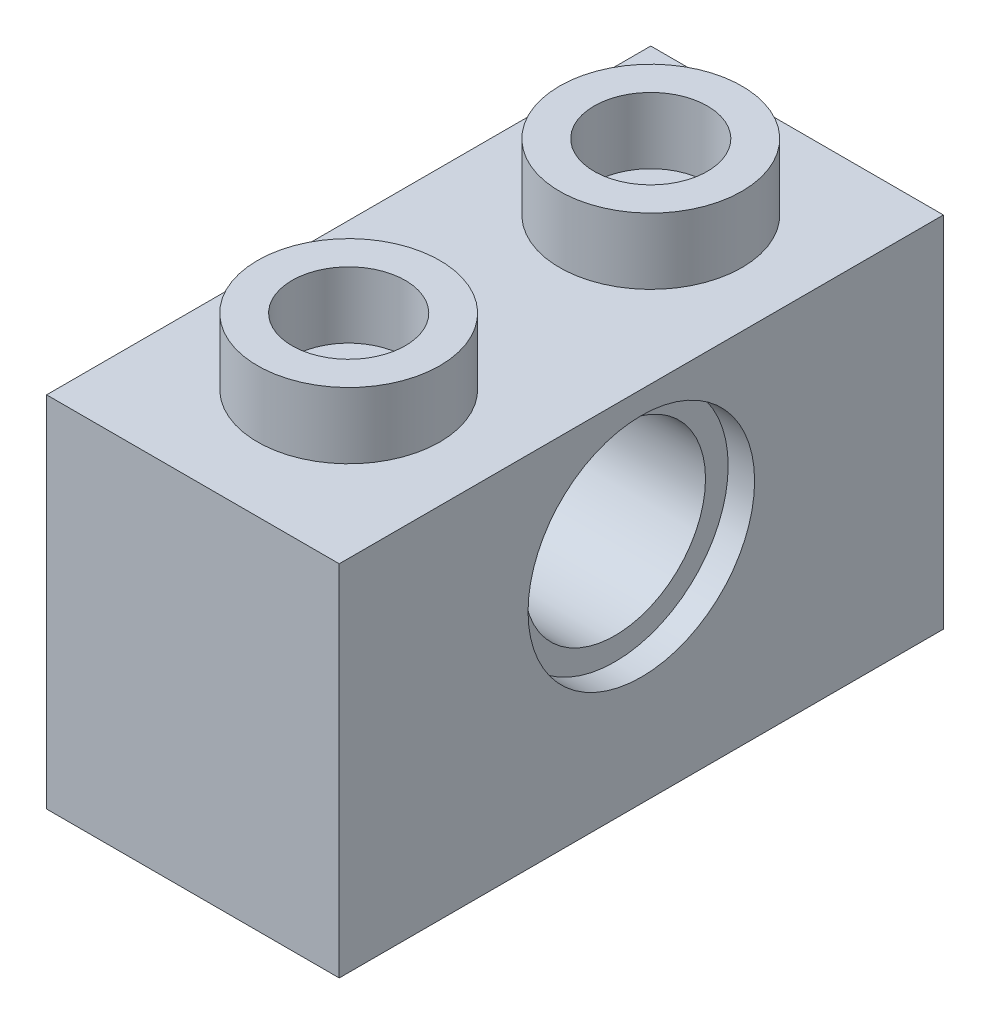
ISO-10303-21;
HEADER;
FILE_DESCRIPTION(('STEP AP214'),'2;1');
FILE_NAME('part.step','',(''),(''),'','','');
FILE_SCHEMA(('AUTOMOTIVE_DESIGN { 1 0 10303 214 1 1 1 1 }'));
ENDSEC;
DATA;
#1=APPLICATION_CONTEXT('core data for automotive mechanical design processes');
#2=APPLICATION_PROTOCOL_DEFINITION('international standard','automotive_design',2000,#1);
#3=PRODUCT_CONTEXT('',#1,'mechanical');
#4=PRODUCT('Part','Part','',(#3));
#5=PRODUCT_RELATED_PRODUCT_CATEGORY('part','',(#4));
#6=PRODUCT_DEFINITION_FORMATION('','',#4);
#7=PRODUCT_DEFINITION_CONTEXT('part definition',#1,'design');
#8=PRODUCT_DEFINITION('design','',#6,#7);
#9=PRODUCT_DEFINITION_SHAPE('','',#8);
#10=(LENGTH_UNIT() NAMED_UNIT(*) SI_UNIT(.MILLI.,.METRE.));
#11=(NAMED_UNIT(*) PLANE_ANGLE_UNIT() SI_UNIT($,.RADIAN.));
#12=(NAMED_UNIT(*) SI_UNIT($,.STERADIAN.) SOLID_ANGLE_UNIT());
#13=UNCERTAINTY_MEASURE_WITH_UNIT(LENGTH_MEASURE(1.E-05),#10,'distance_accuracy_value','');
#14=(GEOMETRIC_REPRESENTATION_CONTEXT(3) GLOBAL_UNCERTAINTY_ASSIGNED_CONTEXT((#13)) GLOBAL_UNIT_ASSIGNED_CONTEXT((#10,
#11,#12)) REPRESENTATION_CONTEXT('',''));
#15=CARTESIAN_POINT('',(0.,0.,0.));
#16=DIRECTION('',(0.,0.,1.));
#17=DIRECTION('',(1.,0.,0.));
#18=AXIS2_PLACEMENT_3D('',#15,#16,#17);
#19=CARTESIAN_POINT('',(-2.425,-3.,1.45));
#20=DIRECTION('',(0.,-1.,0.));
#21=DIRECTION('',(0.,0.,-1.));
#22=AXIS2_PLACEMENT_3D('',#19,#20,#21);
#23=PLANE('',#22);
#24=DIRECTION('',(0.,0.,-1.));
#25=VECTOR('',#24,1.);
#26=CARTESIAN_POINT('',(-2.425,-3.,14.55));
#27=LINE('',#26,#25);
#28=CARTESIAN_POINT('',(-2.425,-3.,14.55));
#29=VERTEX_POINT('',#28);
#30=CARTESIAN_POINT('',(-2.425,-3.,1.45));
#31=VERTEX_POINT('',#30);
#32=EDGE_CURVE('E114',#29,#31,#27,.T.);
#33=ORIENTED_EDGE('',*,*,#32,.T.);
#34=DIRECTION('',(1.,0.,0.));
#35=VECTOR('',#34,1.);
#36=CARTESIAN_POINT('',(-2.425,-3.,1.45));
#37=LINE('',#36,#35);
#38=CARTESIAN_POINT('',(2.425,-3.,1.45));
#39=VERTEX_POINT('',#38);
#40=EDGE_CURVE('E123',#31,#39,#37,.T.);
#41=ORIENTED_EDGE('',*,*,#40,.T.);
#42=DIRECTION('',(0.,0.,1.));
#43=VECTOR('',#42,1.);
#44=CARTESIAN_POINT('',(2.425,-3.,14.55));
#45=LINE('',#44,#43);
#46=CARTESIAN_POINT('',(2.425,-3.,14.55));
#47=VERTEX_POINT('',#46);
#48=EDGE_CURVE('E128',#39,#47,#45,.T.);
#49=ORIENTED_EDGE('',*,*,#48,.T.);
#50=DIRECTION('',(-1.,0.,0.));
#51=VECTOR('',#50,1.);
#52=CARTESIAN_POINT('',(-2.425,-3.,14.55));
#53=LINE('',#52,#51);
#54=EDGE_CURVE('E120',#47,#29,#53,.T.);
#55=ORIENTED_EDGE('',*,*,#54,.T.);
#56=EDGE_LOOP('',(#33,#41,#49,#55));
#57=FACE_BOUND('',#56,.T.);
#58=CARTESIAN_POINT('',(0.,-3.,8.));
#59=DIRECTION('',(0.,-1.,0.));
#60=DIRECTION('',(0.,0.,-1.));
#61=AXIS2_PLACEMENT_3D('',#58,#59,#60);
#62=CIRCLE('',#61,1.5);
#63=CARTESIAN_POINT('',(0.,-3.,6.5));
#64=VERTEX_POINT('',#63);
#65=EDGE_CURVE('E138',#64,#64,#62,.T.);
#66=ORIENTED_EDGE('',*,*,#65,.F.);
#67=EDGE_LOOP('',(#66));
#68=FACE_BOUND('',#67,.T.);
#69=ADVANCED_FACE('F37',(#57,#68),#23,.T.);
#70=CARTESIAN_POINT('',(3.875,4.75,16.));
#71=DIRECTION('',(0.,-1.,0.));
#72=DIRECTION('',(1.,0.,0.));
#73=AXIS2_PLACEMENT_3D('',#70,#71,#72);
#74=PLANE('',#73);
#75=DIRECTION('',(-1.,0.,0.));
#76=VECTOR('',#75,1.);
#77=CARTESIAN_POINT('',(3.875,4.75,0.));
#78=LINE('',#77,#76);
#79=CARTESIAN_POINT('',(3.875,4.75,0.));
#80=VERTEX_POINT('',#79);
#81=CARTESIAN_POINT('',(-3.875,4.75,0.));
#82=VERTEX_POINT('',#81);
#83=EDGE_CURVE('E82',#80,#82,#78,.T.);
#84=ORIENTED_EDGE('',*,*,#83,.T.);
#85=DIRECTION('',(0.,0.,-1.));
#86=VECTOR('',#85,1.);
#87=CARTESIAN_POINT('',(-3.875,4.75,16.));
#88=LINE('',#87,#86);
#89=CARTESIAN_POINT('',(-3.875,4.75,16.));
#90=VERTEX_POINT('',#89);
#91=EDGE_CURVE('E179',#90,#82,#88,.T.);
#92=ORIENTED_EDGE('',*,*,#91,.F.);
#93=DIRECTION('',(-1.,0.,0.));
#94=VECTOR('',#93,1.);
#95=CARTESIAN_POINT('',(3.875,4.75,16.));
#96=LINE('',#95,#94);
#97=CARTESIAN_POINT('',(3.875,4.75,16.));
#98=VERTEX_POINT('',#97);
#99=EDGE_CURVE('E61',#98,#90,#96,.T.);
#100=ORIENTED_EDGE('',*,*,#99,.F.);
#101=DIRECTION('',(0.,0.,-1.));
#102=VECTOR('',#101,1.);
#103=CARTESIAN_POINT('',(3.875,4.75,16.));
#104=LINE('',#103,#102);
#105=EDGE_CURVE('E188',#98,#80,#104,.T.);
#106=ORIENTED_EDGE('',*,*,#105,.T.);
#107=EDGE_LOOP('',(#84,#92,#100,#106));
#108=FACE_BOUND('',#107,.T.);
#109=CARTESIAN_POINT('',(0.,4.75,3.875));
#110=DIRECTION('',(0.,-1.,0.));
#111=DIRECTION('',(1.,0.,0.));
#112=AXIS2_PLACEMENT_3D('',#109,#110,#111);
#113=CIRCLE('',#112,2.415);
#114=CARTESIAN_POINT('',(2.415,4.75,3.875));
#115=VERTEX_POINT('',#114);
#116=EDGE_CURVE('E45',#115,#115,#113,.F.);
#117=ORIENTED_EDGE('',*,*,#116,.F.);
#118=EDGE_LOOP('',(#117));
#119=FACE_BOUND('',#118,.T.);
#120=CARTESIAN_POINT('',(0.,4.75,11.875));
#121=DIRECTION('',(0.,-1.,0.));
#122=DIRECTION('',(1.,0.,0.));
#123=AXIS2_PLACEMENT_3D('',#120,#121,#122);
#124=CIRCLE('',#123,2.415);
#125=CARTESIAN_POINT('',(2.415,4.75,11.875));
#126=VERTEX_POINT('',#125);
#127=EDGE_CURVE('E11',#126,#126,#124,.F.);
#128=ORIENTED_EDGE('',*,*,#127,.F.);
#129=EDGE_LOOP('',(#128));
#130=FACE_BOUND('',#129,.T.);
#131=ADVANCED_FACE('F199',(#108,#119,#130),#74,.F.);
#132=CARTESIAN_POINT('',(-3.875,-4.75,16.));
#133=DIRECTION('',(1.,0.,0.));
#134=DIRECTION('',(0.,0.,-1.));
#135=AXIS2_PLACEMENT_3D('',#132,#133,#134);
#136=PLANE('',#135);
#137=CARTESIAN_POINT('',(-3.875,1.15,8.));
#138=DIRECTION('',(-1.,0.,0.));
#139=DIRECTION('',(0.,0.,1.));
#140=AXIS2_PLACEMENT_3D('',#137,#138,#139);
#141=CIRCLE('',#140,3.);
#142=CARTESIAN_POINT('',(-3.875,1.15,11.));
#143=VERTEX_POINT('',#142);
#144=EDGE_CURVE('E300',#143,#143,#141,.T.);
#145=ORIENTED_EDGE('',*,*,#144,.F.);
#146=EDGE_LOOP('',(#145));
#147=FACE_BOUND('',#146,.T.);
#148=DIRECTION('',(0.,-1.,0.));
#149=VECTOR('',#148,1.);
#150=CARTESIAN_POINT('',(-3.875,-4.75,0.));
#151=LINE('',#150,#149);
#152=CARTESIAN_POINT('',(-3.875,-4.75,0.));
#153=VERTEX_POINT('',#152);
#154=EDGE_CURVE('E172',#82,#153,#151,.T.);
#155=ORIENTED_EDGE('',*,*,#154,.T.);
#156=DIRECTION('',(0.,0.,-1.));
#157=VECTOR('',#156,1.);
#158=CARTESIAN_POINT('',(-3.875,-4.75,16.));
#159=LINE('',#158,#157);
#160=CARTESIAN_POINT('',(-3.875,-4.75,16.));
#161=VERTEX_POINT('',#160);
#162=EDGE_CURVE('E193',#161,#153,#159,.T.);
#163=ORIENTED_EDGE('',*,*,#162,.F.);
#164=DIRECTION('',(0.,-1.,0.));
#165=VECTOR('',#164,1.);
#166=CARTESIAN_POINT('',(-3.875,-4.75,16.));
#167=LINE('',#166,#165);
#168=EDGE_CURVE('E173',#90,#161,#167,.T.);
#169=ORIENTED_EDGE('',*,*,#168,.F.);
#170=ORIENTED_EDGE('',*,*,#91,.T.);
#171=EDGE_LOOP('',(#155,#163,#169,#170));
#172=FACE_BOUND('',#171,.T.);
#173=ADVANCED_FACE('F39',(#147,#172),#136,.F.);
#174=CARTESIAN_POINT('',(3.875,-4.75,16.));
#175=DIRECTION('',(0.,1.,0.));
#176=DIRECTION('',(0.,0.,1.));
#177=AXIS2_PLACEMENT_3D('',#174,#175,#176);
#178=PLANE('',#177);
#179=DIRECTION('',(1.,0.,0.));
#180=VECTOR('',#179,1.);
#181=CARTESIAN_POINT('',(-2.425,-4.75,1.45));
#182=LINE('',#181,#180);
#183=CARTESIAN_POINT('',(-2.425,-4.75,1.45));
#184=VERTEX_POINT('',#183);
#185=CARTESIAN_POINT('',(2.425,-4.75,1.45));
#186=VERTEX_POINT('',#185);
#187=EDGE_CURVE('E144',#184,#186,#182,.T.);
#188=ORIENTED_EDGE('',*,*,#187,.F.);
#189=DIRECTION('',(0.,0.,-1.));
#190=VECTOR('',#189,1.);
#191=CARTESIAN_POINT('',(-2.425,-4.75,14.55));
#192=LINE('',#191,#190);
#193=CARTESIAN_POINT('',(-2.425,-4.75,14.55));
#194=VERTEX_POINT('',#193);
#195=EDGE_CURVE('E52',#194,#184,#192,.T.);
#196=ORIENTED_EDGE('',*,*,#195,.F.);
#197=DIRECTION('',(-1.,0.,0.));
#198=VECTOR('',#197,1.);
#199=CARTESIAN_POINT('',(-2.425,-4.75,14.55));
#200=LINE('',#199,#198);
#201=CARTESIAN_POINT('',(2.425,-4.75,14.55));
#202=VERTEX_POINT('',#201);
#203=EDGE_CURVE('E132',#202,#194,#200,.T.);
#204=ORIENTED_EDGE('',*,*,#203,.F.);
#205=DIRECTION('',(0.,0.,1.));
#206=VECTOR('',#205,1.);
#207=CARTESIAN_POINT('',(2.425,-4.75,14.55));
#208=LINE('',#207,#206);
#209=EDGE_CURVE('E135',#186,#202,#208,.T.);
#210=ORIENTED_EDGE('',*,*,#209,.F.);
#211=EDGE_LOOP('',(#188,#196,#204,#210));
#212=FACE_BOUND('',#211,.T.);
#213=DIRECTION('',(1.,0.,0.));
#214=VECTOR('',#213,1.);
#215=CARTESIAN_POINT('',(3.875,-4.75,0.));
#216=LINE('',#215,#214);
#217=CARTESIAN_POINT('',(3.875,-4.75,0.));
#218=VERTEX_POINT('',#217);
#219=EDGE_CURVE('E182',#153,#218,#216,.T.);
#220=ORIENTED_EDGE('',*,*,#219,.T.);
#221=DIRECTION('',(0.,0.,-1.));
#222=VECTOR('',#221,1.);
#223=CARTESIAN_POINT('',(3.875,-4.75,16.));
#224=LINE('',#223,#222);
#225=CARTESIAN_POINT('',(3.875,-4.75,16.));
#226=VERTEX_POINT('',#225);
#227=EDGE_CURVE('E190',#226,#218,#224,.T.);
#228=ORIENTED_EDGE('',*,*,#227,.F.);
#229=DIRECTION('',(1.,0.,0.));
#230=VECTOR('',#229,1.);
#231=CARTESIAN_POINT('',(3.875,-4.75,16.));
#232=LINE('',#231,#230);
#233=EDGE_CURVE('E90',#161,#226,#232,.T.);
#234=ORIENTED_EDGE('',*,*,#233,.F.);
#235=ORIENTED_EDGE('',*,*,#162,.T.);
#236=EDGE_LOOP('',(#220,#228,#234,#235));
#237=FACE_BOUND('',#236,.T.);
#238=ADVANCED_FACE('F285',(#212,#237),#178,.F.);
#239=CARTESIAN_POINT('',(3.875,-4.75,16.));
#240=DIRECTION('',(-1.,0.,0.));
#241=DIRECTION('',(0.,0.,1.));
#242=AXIS2_PLACEMENT_3D('',#239,#240,#241);
#243=PLANE('',#242);
#244=CARTESIAN_POINT('',(3.875,1.15,8.));
#245=DIRECTION('',(1.,0.,0.));
#246=DIRECTION('',(0.,0.,-1.));
#247=AXIS2_PLACEMENT_3D('',#244,#245,#246);
#248=CIRCLE('',#247,3.);
#249=CARTESIAN_POINT('',(3.875,1.15,5.));
#250=VERTEX_POINT('',#249);
#251=EDGE_CURVE('E306',#250,#250,#248,.T.);
#252=ORIENTED_EDGE('',*,*,#251,.F.);
#253=EDGE_LOOP('',(#252));
#254=FACE_BOUND('',#253,.T.);
#255=DIRECTION('',(0.,1.,0.));
#256=VECTOR('',#255,1.);
#257=CARTESIAN_POINT('',(3.875,-4.75,0.));
#258=LINE('',#257,#256);
#259=EDGE_CURVE('E184',#218,#80,#258,.T.);
#260=ORIENTED_EDGE('',*,*,#259,.T.);
#261=ORIENTED_EDGE('',*,*,#105,.F.);
#262=DIRECTION('',(0.,1.,0.));
#263=VECTOR('',#262,1.);
#264=CARTESIAN_POINT('',(3.875,-4.75,16.));
#265=LINE('',#264,#263);
#266=EDGE_CURVE('E176',#226,#98,#265,.T.);
#267=ORIENTED_EDGE('',*,*,#266,.F.);
#268=ORIENTED_EDGE('',*,*,#227,.T.);
#269=EDGE_LOOP('',(#260,#261,#267,#268));
#270=FACE_BOUND('',#269,.T.);
#271=ADVANCED_FACE('F272',(#254,#270),#243,.F.);
#272=CARTESIAN_POINT('',(-3.875,4.75,16.));
#273=DIRECTION('',(0.,0.,1.));
#274=DIRECTION('',(1.,0.,0.));
#275=AXIS2_PLACEMENT_3D('',#272,#273,#274);
#276=PLANE('',#275);
#277=ORIENTED_EDGE('',*,*,#168,.T.);
#278=ORIENTED_EDGE('',*,*,#233,.T.);
#279=ORIENTED_EDGE('',*,*,#266,.T.);
#280=ORIENTED_EDGE('',*,*,#99,.T.);
#281=EDGE_LOOP('',(#277,#278,#279,#280));
#282=FACE_BOUND('',#281,.T.);
#283=ADVANCED_FACE('F270',(#282),#276,.T.);
#284=CARTESIAN_POINT('',(-3.875,4.75,0.));
#285=DIRECTION('',(0.,0.,1.));
#286=DIRECTION('',(1.,0.,0.));
#287=AXIS2_PLACEMENT_3D('',#284,#285,#286);
#288=PLANE('',#287);
#289=ORIENTED_EDGE('',*,*,#154,.F.);
#290=ORIENTED_EDGE('',*,*,#83,.F.);
#291=ORIENTED_EDGE('',*,*,#259,.F.);
#292=ORIENTED_EDGE('',*,*,#219,.F.);
#293=EDGE_LOOP('',(#289,#290,#291,#292));
#294=FACE_BOUND('',#293,.T.);
#295=ADVANCED_FACE('F267',(#294),#288,.F.);
#296=CARTESIAN_POINT('',(0.,6.5,3.875));
#297=DIRECTION('',(0.,1.,0.));
#298=DIRECTION('',(-1.,0.,0.));
#299=AXIS2_PLACEMENT_3D('',#296,#297,#298);
#300=PLANE('',#299);
#301=CARTESIAN_POINT('',(0.,6.5,3.875));
#302=DIRECTION('',(0.,1.,0.));
#303=DIRECTION('',(-1.,0.,0.));
#304=AXIS2_PLACEMENT_3D('',#301,#302,#303);
#305=CIRCLE('',#304,2.415);
#306=CARTESIAN_POINT('',(-2.415,6.5,3.875));
#307=VERTEX_POINT('',#306);
#308=EDGE_CURVE('E167',#307,#307,#305,.T.);
#309=ORIENTED_EDGE('',*,*,#308,.T.);
#310=EDGE_LOOP('',(#309));
#311=FACE_BOUND('',#310,.T.);
#312=CARTESIAN_POINT('',(0.,6.5,3.875));
#313=DIRECTION('',(0.,1.,0.));
#314=DIRECTION('',(-1.,0.,0.));
#315=AXIS2_PLACEMENT_3D('',#312,#313,#314);
#316=CIRCLE('',#315,1.5);
#317=CARTESIAN_POINT('',(-1.5,6.5,3.875));
#318=VERTEX_POINT('',#317);
#319=EDGE_CURVE('E164',#318,#318,#316,.T.);
#320=ORIENTED_EDGE('',*,*,#319,.F.);
#321=EDGE_LOOP('',(#320));
#322=FACE_BOUND('',#321,.T.);
#323=ADVANCED_FACE('F262',(#311,#322),#300,.T.);
#324=CARTESIAN_POINT('',(0.,6.5,3.875));
#325=DIRECTION('',(0.,-1.,0.));
#326=DIRECTION('',(1.,0.,0.));
#327=AXIS2_PLACEMENT_3D('',#324,#325,#326);
#328=CYLINDRICAL_SURFACE('',#327,2.415);
#329=ORIENTED_EDGE('',*,*,#308,.F.);
#330=EDGE_LOOP('',(#329));
#331=FACE_BOUND('',#330,.T.);
#332=ORIENTED_EDGE('',*,*,#116,.T.);
#333=EDGE_LOOP('',(#332));
#334=FACE_BOUND('',#333,.T.);
#335=ADVANCED_FACE('F197',(#331,#334),#328,.T.);
#336=CARTESIAN_POINT('',(0.,6.5,3.875));
#337=DIRECTION('',(0.,-1.,0.));
#338=DIRECTION('',(1.,0.,0.));
#339=AXIS2_PLACEMENT_3D('',#336,#337,#338);
#340=CYLINDRICAL_SURFACE('',#339,1.5);
#341=ORIENTED_EDGE('',*,*,#319,.T.);
#342=EDGE_LOOP('',(#341));
#343=FACE_BOUND('',#342,.T.);
#344=CARTESIAN_POINT('',(0.,4.75,3.875));
#345=DIRECTION('',(0.,1.,0.));
#346=DIRECTION('',(-1.,0.,0.));
#347=AXIS2_PLACEMENT_3D('',#344,#345,#346);
#348=CIRCLE('',#347,1.5);
#349=CARTESIAN_POINT('',(-1.5,4.75,3.875));
#350=VERTEX_POINT('',#349);
#351=EDGE_CURVE('E163',#350,#350,#348,.T.);
#352=ORIENTED_EDGE('',*,*,#351,.F.);
#353=EDGE_LOOP('',(#352));
#354=FACE_BOUND('',#353,.T.);
#355=ADVANCED_FACE('F251',(#343,#354),#340,.F.);
#356=ORIENTED_EDGE('',*,*,#351,.T.);
#357=EDGE_LOOP('',(#356));
#358=FACE_BOUND('',#357,.T.);
#359=ADVANCED_FACE('F204',(#358),#74,.F.);
#360=CARTESIAN_POINT('',(0.,6.5,11.875));
#361=DIRECTION('',(0.,1.,0.));
#362=DIRECTION('',(-1.,0.,0.));
#363=AXIS2_PLACEMENT_3D('',#360,#361,#362);
#364=PLANE('',#363);
#365=CARTESIAN_POINT('',(0.,6.5,11.875));
#366=DIRECTION('',(0.,1.,0.));
#367=DIRECTION('',(-1.,0.,0.));
#368=AXIS2_PLACEMENT_3D('',#365,#366,#367);
#369=CIRCLE('',#368,2.415);
#370=CARTESIAN_POINT('',(-2.415,6.5,11.875));
#371=VERTEX_POINT('',#370);
#372=EDGE_CURVE('E158',#371,#371,#369,.T.);
#373=ORIENTED_EDGE('',*,*,#372,.T.);
#374=EDGE_LOOP('',(#373));
#375=FACE_BOUND('',#374,.T.);
#376=CARTESIAN_POINT('',(0.,6.5,11.875));
#377=DIRECTION('',(0.,1.,0.));
#378=DIRECTION('',(-1.,0.,0.));
#379=AXIS2_PLACEMENT_3D('',#376,#377,#378);
#380=CIRCLE('',#379,1.5);
#381=CARTESIAN_POINT('',(-1.5,6.5,11.875));
#382=VERTEX_POINT('',#381);
#383=EDGE_CURVE('E155',#382,#382,#380,.T.);
#384=ORIENTED_EDGE('',*,*,#383,.F.);
#385=EDGE_LOOP('',(#384));
#386=FACE_BOUND('',#385,.T.);
#387=ADVANCED_FACE('F210',(#375,#386),#364,.T.);
#388=CARTESIAN_POINT('',(0.,6.5,11.875));
#389=DIRECTION('',(0.,-1.,0.));
#390=DIRECTION('',(1.,0.,0.));
#391=AXIS2_PLACEMENT_3D('',#388,#389,#390);
#392=CYLINDRICAL_SURFACE('',#391,2.415);
#393=ORIENTED_EDGE('',*,*,#372,.F.);
#394=EDGE_LOOP('',(#393));
#395=FACE_BOUND('',#394,.T.);
#396=ORIENTED_EDGE('',*,*,#127,.T.);
#397=EDGE_LOOP('',(#396));
#398=FACE_BOUND('',#397,.T.);
#399=ADVANCED_FACE('F207',(#395,#398),#392,.T.);
#400=CARTESIAN_POINT('',(0.,6.5,11.875));
#401=DIRECTION('',(0.,-1.,0.));
#402=DIRECTION('',(1.,0.,0.));
#403=AXIS2_PLACEMENT_3D('',#400,#401,#402);
#404=CYLINDRICAL_SURFACE('',#403,1.5);
#405=ORIENTED_EDGE('',*,*,#383,.T.);
#406=EDGE_LOOP('',(#405));
#407=FACE_BOUND('',#406,.T.);
#408=CARTESIAN_POINT('',(0.,4.75,11.875));
#409=DIRECTION('',(0.,1.,0.));
#410=DIRECTION('',(-1.,0.,0.));
#411=AXIS2_PLACEMENT_3D('',#408,#409,#410);
#412=CIRCLE('',#411,1.5);
#413=CARTESIAN_POINT('',(-1.5,4.75,11.875));
#414=VERTEX_POINT('',#413);
#415=EDGE_CURVE('E151',#414,#414,#412,.T.);
#416=ORIENTED_EDGE('',*,*,#415,.F.);
#417=EDGE_LOOP('',(#416));
#418=FACE_BOUND('',#417,.T.);
#419=ADVANCED_FACE('F209',(#407,#418),#404,.F.);
#420=ORIENTED_EDGE('',*,*,#415,.T.);
#421=EDGE_LOOP('',(#420));
#422=FACE_BOUND('',#421,.T.);
#423=ADVANCED_FACE('F203',(#422),#74,.F.);
#424=CARTESIAN_POINT('',(-2.425,-3.,14.55));
#425=DIRECTION('',(-1.,0.,0.));
#426=DIRECTION('',(0.,0.,1.));
#427=AXIS2_PLACEMENT_3D('',#424,#425,#426);
#428=PLANE('',#427);
#429=ORIENTED_EDGE('',*,*,#195,.T.);
#430=DIRECTION('',(0.,-1.,0.));
#431=VECTOR('',#430,1.);
#432=CARTESIAN_POINT('',(-2.425,-3.,1.45));
#433=LINE('',#432,#431);
#434=EDGE_CURVE('E110',#31,#184,#433,.T.);
#435=ORIENTED_EDGE('',*,*,#434,.F.);
#436=ORIENTED_EDGE('',*,*,#32,.F.);
#437=DIRECTION('',(0.,-1.,0.));
#438=VECTOR('',#437,1.);
#439=CARTESIAN_POINT('',(-2.425,-3.,14.55));
#440=LINE('',#439,#438);
#441=EDGE_CURVE('E149',#29,#194,#440,.T.);
#442=ORIENTED_EDGE('',*,*,#441,.T.);
#443=EDGE_LOOP('',(#429,#435,#436,#442));
#444=FACE_BOUND('',#443,.T.);
#445=ADVANCED_FACE('F112',(#444),#428,.F.);
#446=CARTESIAN_POINT('',(-2.425,-3.,14.55));
#447=DIRECTION('',(0.,0.,1.));
#448=DIRECTION('',(1.,0.,0.));
#449=AXIS2_PLACEMENT_3D('',#446,#447,#448);
#450=PLANE('',#449);
#451=ORIENTED_EDGE('',*,*,#203,.T.);
#452=ORIENTED_EDGE('',*,*,#441,.F.);
#453=ORIENTED_EDGE('',*,*,#54,.F.);
#454=DIRECTION('',(0.,-1.,0.));
#455=VECTOR('',#454,1.);
#456=CARTESIAN_POINT('',(2.425,-3.,14.55));
#457=LINE('',#456,#455);
#458=EDGE_CURVE('E152',#47,#202,#457,.T.);
#459=ORIENTED_EDGE('',*,*,#458,.T.);
#460=EDGE_LOOP('',(#451,#452,#453,#459));
#461=FACE_BOUND('',#460,.T.);
#462=ADVANCED_FACE('F231',(#461),#450,.F.);
#463=CARTESIAN_POINT('',(2.425,-3.,14.55));
#464=DIRECTION('',(1.,0.,0.));
#465=DIRECTION('',(0.,0.,-1.));
#466=AXIS2_PLACEMENT_3D('',#463,#464,#465);
#467=PLANE('',#466);
#468=ORIENTED_EDGE('',*,*,#209,.T.);
#469=ORIENTED_EDGE('',*,*,#458,.F.);
#470=ORIENTED_EDGE('',*,*,#48,.F.);
#471=DIRECTION('',(0.,-1.,0.));
#472=VECTOR('',#471,1.);
#473=CARTESIAN_POINT('',(2.425,-3.,1.45));
#474=LINE('',#473,#472);
#475=EDGE_CURVE('E119',#39,#186,#474,.T.);
#476=ORIENTED_EDGE('',*,*,#475,.T.);
#477=EDGE_LOOP('',(#468,#469,#470,#476));
#478=FACE_BOUND('',#477,.T.);
#479=ADVANCED_FACE('F234',(#478),#467,.F.);
#480=CARTESIAN_POINT('',(-2.425,-3.,1.45));
#481=DIRECTION('',(0.,0.,-1.));
#482=DIRECTION('',(-1.,0.,0.));
#483=AXIS2_PLACEMENT_3D('',#480,#481,#482);
#484=PLANE('',#483);
#485=ORIENTED_EDGE('',*,*,#187,.T.);
#486=ORIENTED_EDGE('',*,*,#475,.F.);
#487=ORIENTED_EDGE('',*,*,#40,.F.);
#488=ORIENTED_EDGE('',*,*,#434,.T.);
#489=EDGE_LOOP('',(#485,#486,#487,#488));
#490=FACE_BOUND('',#489,.T.);
#491=ADVANCED_FACE('F124',(#490),#484,.F.);
#492=CARTESIAN_POINT('',(0.,-4.75,8.));
#493=DIRECTION('',(0.,1.,0.));
#494=DIRECTION('',(0.,0.,1.));
#495=AXIS2_PLACEMENT_3D('',#492,#493,#494);
#496=CYLINDRICAL_SURFACE('',#495,1.5);
#497=CARTESIAN_POINT('',(0.,-4.75,8.));
#498=DIRECTION('',(0.,-1.,0.));
#499=DIRECTION('',(0.,0.,-1.));
#500=AXIS2_PLACEMENT_3D('',#497,#498,#499);
#501=CIRCLE('',#500,1.5);
#502=CARTESIAN_POINT('',(0.,-4.75,6.5));
#503=VERTEX_POINT('',#502);
#504=EDGE_CURVE('E145',#503,#503,#501,.T.);
#505=ORIENTED_EDGE('',*,*,#504,.F.);
#506=EDGE_LOOP('',(#505));
#507=FACE_BOUND('',#506,.T.);
#508=ORIENTED_EDGE('',*,*,#65,.T.);
#509=EDGE_LOOP('',(#508));
#510=FACE_BOUND('',#509,.T.);
#511=ADVANCED_FACE('F229',(#507,#510),#496,.T.);
#512=CARTESIAN_POINT('',(0.,-4.75,8.));
#513=DIRECTION('',(0.,-1.,0.));
#514=DIRECTION('',(0.,0.,-1.));
#515=AXIS2_PLACEMENT_3D('',#512,#513,#514);
#516=PLANE('',#515);
#517=ORIENTED_EDGE('',*,*,#504,.T.);
#518=EDGE_LOOP('',(#517));
#519=FACE_BOUND('',#518,.T.);
#520=ADVANCED_FACE('F323',(#519),#516,.T.);
#521=CARTESIAN_POINT('',(3.175,1.15,8.));
#522=DIRECTION('',(1.,0.,0.));
#523=DIRECTION('',(0.,0.,-1.));
#524=AXIS2_PLACEMENT_3D('',#521,#522,#523);
#525=CYLINDRICAL_SURFACE('',#524,3.);
#526=CARTESIAN_POINT('',(3.175,1.15,8.));
#527=DIRECTION('',(1.,0.,0.));
#528=DIRECTION('',(0.,0.,-1.));
#529=AXIS2_PLACEMENT_3D('',#526,#527,#528);
#530=CIRCLE('',#529,3.);
#531=CARTESIAN_POINT('',(3.175,1.15,5.));
#532=VERTEX_POINT('',#531);
#533=EDGE_CURVE('E312',#532,#532,#530,.T.);
#534=ORIENTED_EDGE('',*,*,#533,.F.);
#535=EDGE_LOOP('',(#534));
#536=FACE_BOUND('',#535,.T.);
#537=ORIENTED_EDGE('',*,*,#251,.T.);
#538=EDGE_LOOP('',(#537));
#539=FACE_BOUND('',#538,.T.);
#540=ADVANCED_FACE('F328',(#536,#539),#525,.F.);
#541=CARTESIAN_POINT('',(3.175,1.15,8.));
#542=DIRECTION('',(1.,0.,0.));
#543=DIRECTION('',(0.,0.,-1.));
#544=AXIS2_PLACEMENT_3D('',#541,#542,#543);
#545=PLANE('',#544);
#546=CARTESIAN_POINT('',(3.175,1.15,8.));
#547=DIRECTION('',(1.,0.,0.));
#548=DIRECTION('',(0.,0.,-1.));
#549=AXIS2_PLACEMENT_3D('',#546,#547,#548);
#550=CIRCLE('',#549,2.4);
#551=CARTESIAN_POINT('',(3.175,1.15,5.6));
#552=VERTEX_POINT('',#551);
#553=EDGE_CURVE('E303',#552,#552,#550,.T.);
#554=ORIENTED_EDGE('',*,*,#553,.F.);
#555=EDGE_LOOP('',(#554));
#556=FACE_BOUND('',#555,.T.);
#557=ORIENTED_EDGE('',*,*,#533,.T.);
#558=EDGE_LOOP('',(#557));
#559=FACE_BOUND('',#558,.T.);
#560=ADVANCED_FACE('F332',(#556,#559),#545,.T.);
#561=CARTESIAN_POINT('',(-3.175,1.15,8.));
#562=DIRECTION('',(-1.,0.,0.));
#563=DIRECTION('',(0.,0.,1.));
#564=AXIS2_PLACEMENT_3D('',#561,#562,#563);
#565=CYLINDRICAL_SURFACE('',#564,3.);
#566=CARTESIAN_POINT('',(-3.175,1.15,8.));
#567=DIRECTION('',(-1.,0.,0.));
#568=DIRECTION('',(0.,0.,1.));
#569=AXIS2_PLACEMENT_3D('',#566,#567,#568);
#570=CIRCLE('',#569,3.);
#571=CARTESIAN_POINT('',(-3.175,1.15,11.));
#572=VERTEX_POINT('',#571);
#573=EDGE_CURVE('E302',#572,#572,#570,.T.);
#574=ORIENTED_EDGE('',*,*,#573,.F.);
#575=EDGE_LOOP('',(#574));
#576=FACE_BOUND('',#575,.T.);
#577=ORIENTED_EDGE('',*,*,#144,.T.);
#578=EDGE_LOOP('',(#577));
#579=FACE_BOUND('',#578,.T.);
#580=ADVANCED_FACE('F338',(#576,#579),#565,.F.);
#581=CARTESIAN_POINT('',(-3.175,1.15,8.));
#582=DIRECTION('',(-1.,0.,0.));
#583=DIRECTION('',(0.,0.,1.));
#584=AXIS2_PLACEMENT_3D('',#581,#582,#583);
#585=PLANE('',#584);
#586=CARTESIAN_POINT('',(-3.175,1.15,8.));
#587=DIRECTION('',(-1.,0.,0.));
#588=DIRECTION('',(0.,0.,1.));
#589=AXIS2_PLACEMENT_3D('',#586,#587,#588);
#590=CIRCLE('',#589,2.4);
#591=CARTESIAN_POINT('',(-3.175,1.15,10.4));
#592=VERTEX_POINT('',#591);
#593=EDGE_CURVE('E309',#592,#592,#590,.T.);
#594=ORIENTED_EDGE('',*,*,#593,.F.);
#595=EDGE_LOOP('',(#594));
#596=FACE_BOUND('',#595,.T.);
#597=ORIENTED_EDGE('',*,*,#573,.T.);
#598=EDGE_LOOP('',(#597));
#599=FACE_BOUND('',#598,.T.);
#600=ADVANCED_FACE('F342',(#596,#599),#585,.T.);
#601=CARTESIAN_POINT('',(3.875,1.15,8.));
#602=DIRECTION('',(-1.,0.,0.));
#603=DIRECTION('',(0.,0.,1.));
#604=AXIS2_PLACEMENT_3D('',#601,#602,#603);
#605=CYLINDRICAL_SURFACE('',#604,2.4);
#606=ORIENTED_EDGE('',*,*,#553,.T.);
#607=EDGE_LOOP('',(#606));
#608=FACE_BOUND('',#607,.T.);
#609=ORIENTED_EDGE('',*,*,#593,.T.);
#610=EDGE_LOOP('',(#609));
#611=FACE_BOUND('',#610,.T.);
#612=ADVANCED_FACE('F346',(#608,#611),#605,.F.);
#613=CLOSED_SHELL('',(#69,#131,#173,#238,#271,#283,#295,#323,#335,#355,#359,#387,#399,#419,#423,
#445,#462,#479,#491,#511,#520,#540,#560,#580,#600,#612));
#614=MANIFOLD_SOLID_BREP('B2',#613);
#615=ADVANCED_BREP_SHAPE_REPRESENTATION('',(#18,#614),#14);
#616=SHAPE_DEFINITION_REPRESENTATION(#9,#615);
ENDSEC;
END-ISO-10303-21;
